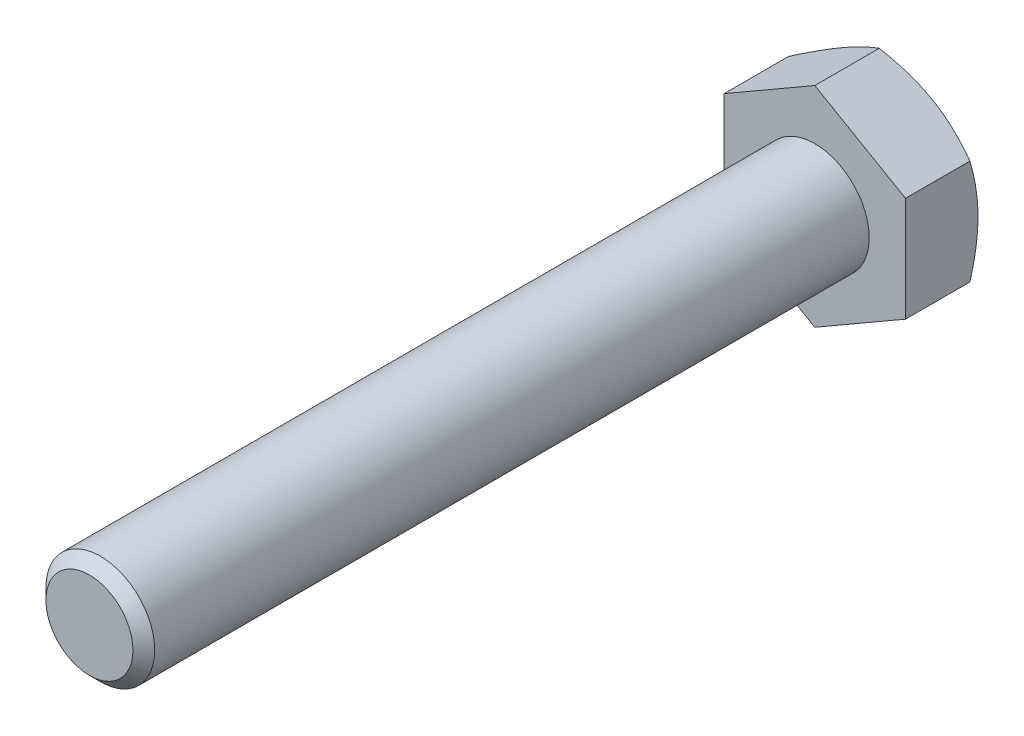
from build123d import *

# Parameters (mm, degrees)
ESQUISSE1_W        = 3
ESQUISSE1_H        = 40
CHANFREIN1_SIZE    = 0.6
BOSS_EXTRU_1_DEPTH = 4


with BuildPart() as part:
    # Esquisse1 → Base-R_volution (revolve)
    with BuildSketch(Plane(origin=(0, 0, 0), x_dir=(1, 0, 0), z_dir=(0, 1, 0))):
        with Locations((1.5, -20)):
            Rectangle(ESQUISSE1_W, ESQUISSE1_H)
    revolve(axis=Axis((0, 0, 0), (0, 0, 1)))

    # Chanfrein1
    chanfrein1_edges = [part.edges().sort_by_distance(p)[0] for p in [
        (-3, 0, 40),
    ]]
    chamfer(chanfrein1_edges, length=CHANFREIN1_SIZE)

    # Esquisse6 → Boss.-Extru.1 (add)
    with BuildSketch(Plane.XY):
        Polygon((5, -2.886751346), (5, 2.886751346), (0, 5.773502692), (-5, 2.886751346), (-5, -2.886751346), (0, -5.773502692), align=None)
    extrude(amount=-BOSS_EXTRU_1_DEPTH)

    # Esquisse7 → Enl_vement de mati_re-R_volution1 (revolve, cut)
    with BuildSketch(Plane(origin=(0, 0, 0), x_dir=(1, 0, 0), z_dir=(0, 1, 0))):
        Polygon((-5, 4), (-11.92820323, 4), (-11.92820323, 0), align=None)
    revolve(axis=Axis((0, 0, -6.239446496), (0, 0, 1)), mode=Mode.SUBTRACT)


solid = part.part
